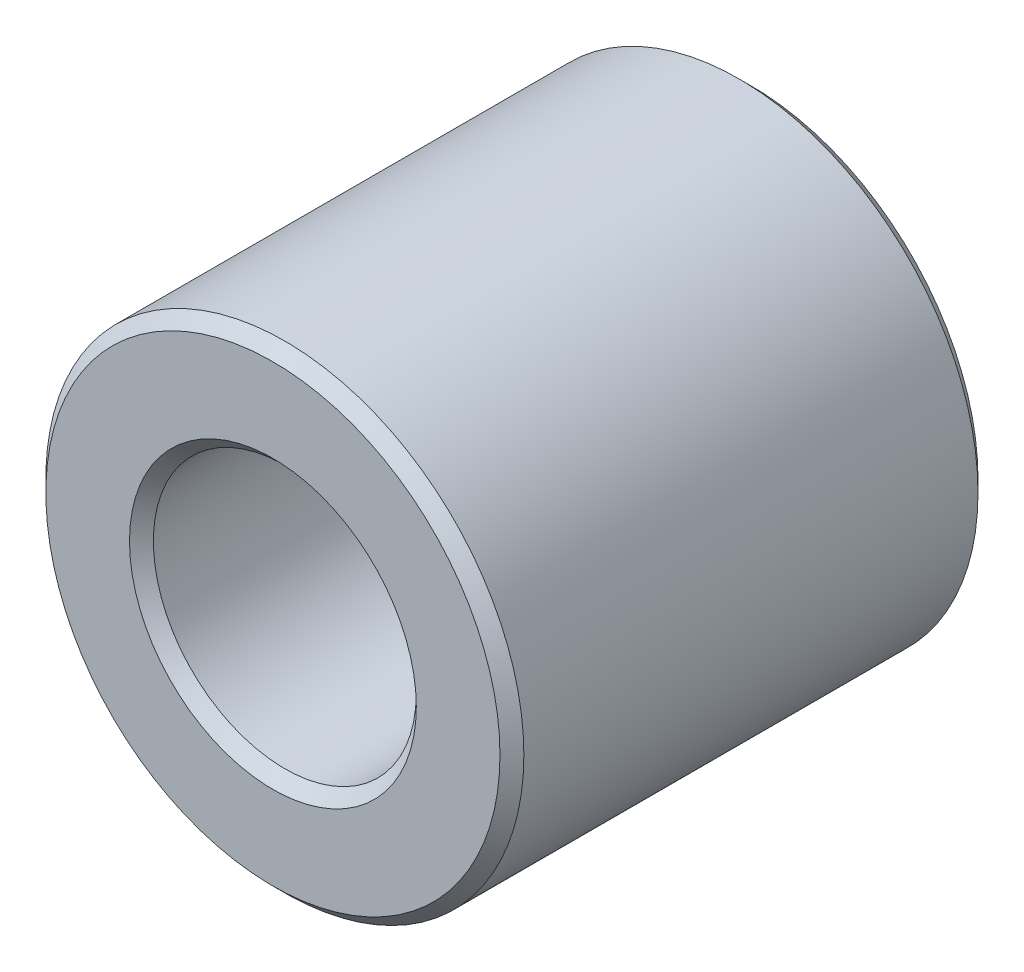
from build123d import *

# Parameters (mm, degrees)
SKETCH1_R           = 2
SKETCH1_R_2         = 1.1
BOSS_EXTRUDE2_DEPTH = 2
CHAMFER3_SIZE       = 0.1


with BuildPart() as part:
    # Sketch1 → Boss-Extrude2 (new, symmetric)
    with BuildSketch(Plane.XY):
        Circle(SKETCH1_R)
        Circle(SKETCH1_R_2, mode=Mode.SUBTRACT)
    extrude(amount=BOSS_EXTRUDE2_DEPTH, both=True)

    # Chamfer3
    chamfer3_edges = [part.edges().sort_by_distance(p)[0] for p in [
        (-2, 0, -2),
        (-2, 0, 2),
        (-1.1, 0, -2),
        (-1.1, 0, 2),
    ]]
    chamfer(chamfer3_edges, length=CHAMFER3_SIZE)


solid = part.part
